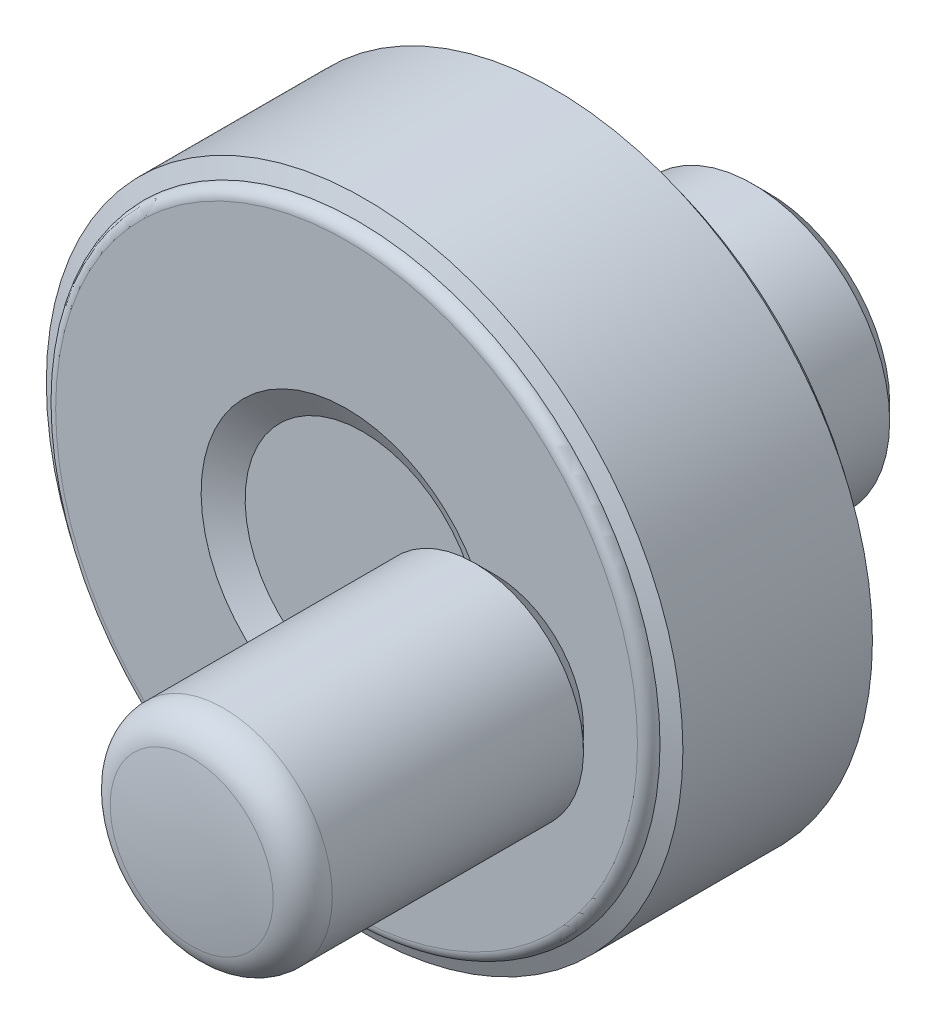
ISO-10303-21;
HEADER;
FILE_DESCRIPTION(('STEP AP214'),'2;1');
FILE_NAME('part.step','',(''),(''),'','','');
FILE_SCHEMA(('AUTOMOTIVE_DESIGN { 1 0 10303 214 1 1 1 1 }'));
ENDSEC;
DATA;
#1=APPLICATION_CONTEXT('core data for automotive mechanical design processes');
#2=APPLICATION_PROTOCOL_DEFINITION('international standard','automotive_design',2000,#1);
#3=PRODUCT_CONTEXT('',#1,'mechanical');
#4=PRODUCT('Part','Part','',(#3));
#5=PRODUCT_RELATED_PRODUCT_CATEGORY('part','',(#4));
#6=PRODUCT_DEFINITION_FORMATION('','',#4);
#7=PRODUCT_DEFINITION_CONTEXT('part definition',#1,'design');
#8=PRODUCT_DEFINITION('design','',#6,#7);
#9=PRODUCT_DEFINITION_SHAPE('','',#8);
#10=(LENGTH_UNIT() NAMED_UNIT(*) SI_UNIT(.MILLI.,.METRE.));
#11=(NAMED_UNIT(*) PLANE_ANGLE_UNIT() SI_UNIT($,.RADIAN.));
#12=(NAMED_UNIT(*) SI_UNIT($,.STERADIAN.) SOLID_ANGLE_UNIT());
#13=UNCERTAINTY_MEASURE_WITH_UNIT(LENGTH_MEASURE(1.E-05),#10,'distance_accuracy_value','');
#14=(GEOMETRIC_REPRESENTATION_CONTEXT(3) GLOBAL_UNCERTAINTY_ASSIGNED_CONTEXT((#13)) GLOBAL_UNIT_ASSIGNED_CONTEXT((#10,
#11,#12)) REPRESENTATION_CONTEXT('',''));
#15=CARTESIAN_POINT('',(0.,0.,0.));
#16=DIRECTION('',(0.,0.,1.));
#17=DIRECTION('',(1.,0.,0.));
#18=AXIS2_PLACEMENT_3D('',#15,#16,#17);
#19=CARTESIAN_POINT('',(-6.66666666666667,0.,2.84529946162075));
#20=DIRECTION('',(0.,-0.5,-0.866025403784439));
#21=DIRECTION('',(0.,-0.866025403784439,0.5));
#22=AXIS2_PLACEMENT_3D('',#19,#20,#21);
#23=PLANE('',#22);
#24=DIRECTION('',(1.,0.,0.));
#25=VECTOR('',#24,1.);
#26=CARTESIAN_POINT('',(-6.66666666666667,-1.,3.42264973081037));
#27=LINE('',#26,#25);
#28=CARTESIAN_POINT('',(-8.5,-1.,3.42264973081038));
#29=VERTEX_POINT('',#28);
#30=CARTESIAN_POINT('',(-6.66666666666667,-1.,3.42264973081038));
#31=VERTEX_POINT('',#30);
#32=EDGE_CURVE('E336',#29,#31,#27,.T.);
#33=ORIENTED_EDGE('',*,*,#32,.T.);
#34=DIRECTION('',(0.,-0.866025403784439,0.5));
#35=VECTOR('',#34,1.);
#36=CARTESIAN_POINT('',(-6.66666666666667,0.,2.84529946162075));
#37=LINE('',#36,#35);
#38=CARTESIAN_POINT('',(-6.66666666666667,0.,2.84529946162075));
#39=VERTEX_POINT('',#38);
#40=EDGE_CURVE('E341',#39,#31,#37,.T.);
#41=ORIENTED_EDGE('',*,*,#40,.F.);
#42=DIRECTION('',(-1.,0.,0.));
#43=VECTOR('',#42,1.);
#44=CARTESIAN_POINT('',(-6.66666666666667,0.,2.84529946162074));
#45=LINE('',#44,#43);
#46=CARTESIAN_POINT('',(-8.5,0.,2.84529946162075));
#47=VERTEX_POINT('',#46);
#48=EDGE_CURVE('E328',#39,#47,#45,.T.);
#49=ORIENTED_EDGE('',*,*,#48,.T.);
#50=DIRECTION('',(0.,-0.866025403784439,0.5));
#51=VECTOR('',#50,1.);
#52=CARTESIAN_POINT('',(-8.5,0.,2.84529946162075));
#53=LINE('',#52,#51);
#54=EDGE_CURVE('E339',#29,#47,#53,.F.);
#55=ORIENTED_EDGE('',*,*,#54,.F.);
#56=EDGE_LOOP('',(#33,#41,#49,#55));
#57=FACE_BOUND('',#56,.T.);
#58=ADVANCED_FACE('F14',(#57),#23,.F.);
#59=CARTESIAN_POINT('',(-6.66666666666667,-1.,3.42264973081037));
#60=DIRECTION('',(0.,-1.,0.));
#61=DIRECTION('',(1.,0.,0.));
#62=AXIS2_PLACEMENT_3D('',#59,#60,#61);
#63=PLANE('',#62);
#64=DIRECTION('',(-1.,0.,0.));
#65=VECTOR('',#64,1.);
#66=CARTESIAN_POINT('',(-6.66666666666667,-1.,4.57735026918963));
#67=LINE('',#66,#65);
#68=CARTESIAN_POINT('',(-8.5,-1.,4.57735026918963));
#69=VERTEX_POINT('',#68);
#70=CARTESIAN_POINT('',(-6.66666666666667,-1.,4.57735026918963));
#71=VERTEX_POINT('',#70);
#72=EDGE_CURVE('E323',#69,#71,#67,.F.);
#73=ORIENTED_EDGE('',*,*,#72,.T.);
#74=DIRECTION('',(0.,0.,1.));
#75=VECTOR('',#74,1.);
#76=CARTESIAN_POINT('',(-6.66666666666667,-1.,3.42264973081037));
#77=LINE('',#76,#75);
#78=EDGE_CURVE('E334',#31,#71,#77,.T.);
#79=ORIENTED_EDGE('',*,*,#78,.F.);
#80=ORIENTED_EDGE('',*,*,#32,.F.);
#81=DIRECTION('',(0.,0.,1.));
#82=VECTOR('',#81,1.);
#83=CARTESIAN_POINT('',(-8.5,-1.,3.42264973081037));
#84=LINE('',#83,#82);
#85=EDGE_CURVE('E331',#69,#29,#84,.F.);
#86=ORIENTED_EDGE('',*,*,#85,.F.);
#87=EDGE_LOOP('',(#73,#79,#80,#86));
#88=FACE_BOUND('',#87,.T.);
#89=ADVANCED_FACE('F386',(#88),#63,.F.);
#90=CARTESIAN_POINT('',(-6.66666666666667,1.,3.42264973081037));
#91=DIRECTION('',(0.,0.5,-0.866025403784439));
#92=DIRECTION('',(0.,-0.866025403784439,-0.5));
#93=AXIS2_PLACEMENT_3D('',#90,#91,#92);
#94=PLANE('',#93);
#95=ORIENTED_EDGE('',*,*,#48,.F.);
#96=DIRECTION('',(0.,-0.866025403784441,-0.5));
#97=VECTOR('',#96,1.);
#98=CARTESIAN_POINT('',(-6.66666666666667,1.,3.42264973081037));
#99=LINE('',#98,#97);
#100=CARTESIAN_POINT('',(-6.66666666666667,1.,3.42264973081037));
#101=VERTEX_POINT('',#100);
#102=EDGE_CURVE('E319',#101,#39,#99,.T.);
#103=ORIENTED_EDGE('',*,*,#102,.F.);
#104=DIRECTION('',(-1.,0.,0.));
#105=VECTOR('',#104,1.);
#106=CARTESIAN_POINT('',(-6.66666666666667,1.,3.42264973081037));
#107=LINE('',#106,#105);
#108=CARTESIAN_POINT('',(-8.5,1.,3.42264973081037));
#109=VERTEX_POINT('',#108);
#110=EDGE_CURVE('E310',#101,#109,#107,.T.);
#111=ORIENTED_EDGE('',*,*,#110,.T.);
#112=DIRECTION('',(0.,-0.866025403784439,-0.5));
#113=VECTOR('',#112,1.);
#114=CARTESIAN_POINT('',(-8.5,1.,3.42264973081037));
#115=LINE('',#114,#113);
#116=EDGE_CURVE('E326',#47,#109,#115,.F.);
#117=ORIENTED_EDGE('',*,*,#116,.F.);
#118=EDGE_LOOP('',(#95,#103,#111,#117));
#119=FACE_BOUND('',#118,.T.);
#120=ADVANCED_FACE('F359',(#119),#94,.F.);
#121=CARTESIAN_POINT('',(0.,0.,20.));
#122=DIRECTION('',(0.,0.,1.));
#123=DIRECTION('',(1.,0.,0.));
#124=AXIS2_PLACEMENT_3D('',#121,#122,#123);
#125=CYLINDRICAL_SURFACE('',#124,19.75);
#126=CARTESIAN_POINT('',(0.,0.,25.38));
#127=DIRECTION('',(0.,0.,1.));
#128=DIRECTION('',(1.,0.,0.));
#129=AXIS2_PLACEMENT_3D('',#126,#127,#128);
#130=CIRCLE('',#129,19.75);
#131=CARTESIAN_POINT('',(19.75,0.,25.38));
#132=VERTEX_POINT('',#131);
#133=EDGE_CURVE('E343',#132,#132,#130,.F.);
#134=ORIENTED_EDGE('',*,*,#133,.T.);
#135=EDGE_LOOP('',(#134));
#136=FACE_BOUND('',#135,.T.);
#137=CARTESIAN_POINT('',(0.,0.,13.62));
#138=DIRECTION('',(0.,0.,1.));
#139=DIRECTION('',(1.,0.,0.));
#140=AXIS2_PLACEMENT_3D('',#137,#138,#139);
#141=CIRCLE('',#140,19.75);
#142=CARTESIAN_POINT('',(19.75,0.,13.62));
#143=VERTEX_POINT('',#142);
#144=EDGE_CURVE('E307',#143,#143,#141,.F.);
#145=ORIENTED_EDGE('',*,*,#144,.F.);
#146=EDGE_LOOP('',(#145));
#147=FACE_BOUND('',#146,.T.);
#148=ADVANCED_FACE('F354',(#136,#147),#125,.T.);
#149=CARTESIAN_POINT('',(-6.66666666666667,-1.,4.57735026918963));
#150=DIRECTION('',(0.,-0.5,0.866025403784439));
#151=DIRECTION('',(0.,0.866025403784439,0.5));
#152=AXIS2_PLACEMENT_3D('',#149,#150,#151);
#153=PLANE('',#152);
#154=DIRECTION('',(-1.,0.,0.));
#155=VECTOR('',#154,1.);
#156=CARTESIAN_POINT('',(-6.66666666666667,0.,5.15470053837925));
#157=LINE('',#156,#155);
#158=CARTESIAN_POINT('',(-8.5,0.,5.15470053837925));
#159=VERTEX_POINT('',#158);
#160=CARTESIAN_POINT('',(-6.66666666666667,0.,5.15470053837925));
#161=VERTEX_POINT('',#160);
#162=EDGE_CURVE('E305',#159,#161,#157,.F.);
#163=ORIENTED_EDGE('',*,*,#162,.T.);
#164=DIRECTION('',(0.,0.866025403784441,0.5));
#165=VECTOR('',#164,1.);
#166=CARTESIAN_POINT('',(-6.66666666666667,-1.,4.57735026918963));
#167=LINE('',#166,#165);
#168=EDGE_CURVE('E316',#71,#161,#167,.T.);
#169=ORIENTED_EDGE('',*,*,#168,.F.);
#170=ORIENTED_EDGE('',*,*,#72,.F.);
#171=DIRECTION('',(0.,0.866025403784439,0.5));
#172=VECTOR('',#171,1.);
#173=CARTESIAN_POINT('',(-8.5,-1.,4.57735026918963));
#174=LINE('',#173,#172);
#175=EDGE_CURVE('E34',#159,#69,#174,.F.);
#176=ORIENTED_EDGE('',*,*,#175,.F.);
#177=EDGE_LOOP('',(#163,#169,#170,#176));
#178=FACE_BOUND('',#177,.T.);
#179=ADVANCED_FACE('F358',(#178),#153,.F.);
#180=CARTESIAN_POINT('',(-6.66666666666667,0.,0.));
#181=DIRECTION('',(-1.,0.,0.));
#182=DIRECTION('',(0.,-1.,0.));
#183=AXIS2_PLACEMENT_3D('',#180,#181,#182);
#184=PLANE('',#183);
#185=ORIENTED_EDGE('',*,*,#78,.T.);
#186=ORIENTED_EDGE('',*,*,#168,.T.);
#187=DIRECTION('',(0.,0.866025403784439,-0.5));
#188=VECTOR('',#187,1.);
#189=CARTESIAN_POINT('',(-6.66666666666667,0.,5.15470053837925));
#190=LINE('',#189,#188);
#191=CARTESIAN_POINT('',(-6.66666666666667,1.,4.57735026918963));
#192=VERTEX_POINT('',#191);
#193=EDGE_CURVE('E303',#161,#192,#190,.T.);
#194=ORIENTED_EDGE('',*,*,#193,.T.);
#195=DIRECTION('',(0.,0.,1.));
#196=VECTOR('',#195,1.);
#197=CARTESIAN_POINT('',(-6.66666666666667,1.,4.57735026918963));
#198=LINE('',#197,#196);
#199=EDGE_CURVE('E313',#192,#101,#198,.F.);
#200=ORIENTED_EDGE('',*,*,#199,.T.);
#201=ORIENTED_EDGE('',*,*,#102,.T.);
#202=ORIENTED_EDGE('',*,*,#40,.T.);
#203=EDGE_LOOP('',(#185,#186,#194,#200,#201,#202));
#204=FACE_BOUND('',#203,.T.);
#205=ADVANCED_FACE('F375',(#204),#184,.T.);
#206=CARTESIAN_POINT('',(-6.66666666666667,1.,4.57735026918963));
#207=DIRECTION('',(0.,1.,0.));
#208=DIRECTION('',(-1.,0.,0.));
#209=AXIS2_PLACEMENT_3D('',#206,#207,#208);
#210=PLANE('',#209);
#211=ORIENTED_EDGE('',*,*,#110,.F.);
#212=ORIENTED_EDGE('',*,*,#199,.F.);
#213=DIRECTION('',(-1.,0.,0.));
#214=VECTOR('',#213,1.);
#215=CARTESIAN_POINT('',(-6.66666666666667,1.,4.57735026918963));
#216=LINE('',#215,#214);
#217=CARTESIAN_POINT('',(-8.5,1.,4.57735026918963));
#218=VERTEX_POINT('',#217);
#219=EDGE_CURVE('E295',#192,#218,#216,.T.);
#220=ORIENTED_EDGE('',*,*,#219,.T.);
#221=DIRECTION('',(0.,0.,1.));
#222=VECTOR('',#221,1.);
#223=CARTESIAN_POINT('',(-8.5,1.,4.57735026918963));
#224=LINE('',#223,#222);
#225=EDGE_CURVE('E308',#109,#218,#224,.T.);
#226=ORIENTED_EDGE('',*,*,#225,.F.);
#227=EDGE_LOOP('',(#211,#212,#220,#226));
#228=FACE_BOUND('',#227,.T.);
#229=ADVANCED_FACE('F366',(#228),#210,.F.);
#230=CARTESIAN_POINT('',(0.,0.,13.62));
#231=DIRECTION('',(0.,0.,1.));
#232=DIRECTION('',(1.,0.,0.));
#233=AXIS2_PLACEMENT_3D('',#230,#231,#232);
#234=CONICAL_SURFACE('',#233,19.75,1.17316833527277);
#235=ORIENTED_EDGE('',*,*,#144,.T.);
#236=EDGE_LOOP('',(#235));
#237=FACE_BOUND('',#236,.T.);
#238=CARTESIAN_POINT('',(0.,0.,13.2));
#239=DIRECTION('',(0.,0.,-1.));
#240=DIRECTION('',(-1.,0.,0.));
#241=AXIS2_PLACEMENT_3D('',#238,#239,#240);
#242=CIRCLE('',#241,18.75);
#243=CARTESIAN_POINT('',(-18.75,0.,13.2));
#244=VERTEX_POINT('',#243);
#245=EDGE_CURVE('E276',#244,#244,#242,.T.);
#246=ORIENTED_EDGE('',*,*,#245,.F.);
#247=EDGE_LOOP('',(#246));
#248=FACE_BOUND('',#247,.T.);
#249=ADVANCED_FACE('F363',(#237,#248),#234,.T.);
#250=CARTESIAN_POINT('',(-6.66666666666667,0.,5.15470053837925));
#251=DIRECTION('',(0.,0.5,0.866025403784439));
#252=DIRECTION('',(0.,0.866025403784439,-0.5));
#253=AXIS2_PLACEMENT_3D('',#250,#251,#252);
#254=PLANE('',#253);
#255=ORIENTED_EDGE('',*,*,#219,.F.);
#256=ORIENTED_EDGE('',*,*,#193,.F.);
#257=ORIENTED_EDGE('',*,*,#162,.F.);
#258=DIRECTION('',(0.,0.866025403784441,-0.5));
#259=VECTOR('',#258,1.);
#260=CARTESIAN_POINT('',(-8.5,0.,5.15470053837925));
#261=LINE('',#260,#259);
#262=EDGE_CURVE('E267',#159,#218,#261,.T.);
#263=ORIENTED_EDGE('',*,*,#262,.T.);
#264=EDGE_LOOP('',(#255,#256,#257,#263));
#265=FACE_BOUND('',#264,.T.);
#266=ADVANCED_FACE('F286',(#265),#254,.F.);
#267=CARTESIAN_POINT('',(0.,0.,13.2));
#268=DIRECTION('',(0.,0.,-1.));
#269=DIRECTION('',(-1.,0.,0.));
#270=AXIS2_PLACEMENT_3D('',#267,#268,#269);
#271=TOROIDAL_SURFACE('',#270,18.05,0.699999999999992);
#272=CARTESIAN_POINT('',(0.,0.,12.5));
#273=DIRECTION('',(0.,0.,1.));
#274=DIRECTION('',(-1.,0.,0.));
#275=AXIS2_PLACEMENT_3D('',#272,#273,#274);
#276=CIRCLE('',#275,18.05);
#277=CARTESIAN_POINT('',(-18.05,0.,12.5));
#278=VERTEX_POINT('',#277);
#279=EDGE_CURVE('E275',#278,#278,#276,.T.);
#280=ORIENTED_EDGE('',*,*,#279,.T.);
#281=EDGE_LOOP('',(#280));
#282=FACE_BOUND('',#281,.T.);
#283=ORIENTED_EDGE('',*,*,#245,.T.);
#284=EDGE_LOOP('',(#283));
#285=FACE_BOUND('',#284,.T.);
#286=ADVANCED_FACE('F281',(#282,#285),#271,.T.);
#287=CARTESIAN_POINT('',(0.,0.,20.));
#288=DIRECTION('',(0.,0.,1.));
#289=DIRECTION('',(1.,0.,0.));
#290=AXIS2_PLACEMENT_3D('',#287,#288,#289);
#291=CYLINDRICAL_SURFACE('',#290,3.);
#292=CARTESIAN_POINT('',(0.,0.,0.));
#293=DIRECTION('',(0.,0.,1.));
#294=DIRECTION('',(1.,0.,0.));
#295=AXIS2_PLACEMENT_3D('',#292,#293,#294);
#296=CIRCLE('',#295,3.);
#297=CARTESIAN_POINT('',(3.,0.,0.));
#298=VERTEX_POINT('',#297);
#299=EDGE_CURVE('E100',#298,#298,#296,.F.);
#300=ORIENTED_EDGE('',*,*,#299,.T.);
#301=EDGE_LOOP('',(#300));
#302=FACE_BOUND('',#301,.T.);
#303=CARTESIAN_POINT('',(0.,0.,14.));
#304=DIRECTION('',(0.,0.,-1.));
#305=DIRECTION('',(1.,0.,0.));
#306=AXIS2_PLACEMENT_3D('',#303,#304,#305);
#307=CIRCLE('',#306,3.);
#308=CARTESIAN_POINT('',(3.,0.,14.));
#309=VERTEX_POINT('',#308);
#310=EDGE_CURVE('E474',#309,#309,#307,.T.);
#311=ORIENTED_EDGE('',*,*,#310,.F.);
#312=EDGE_LOOP('',(#311));
#313=FACE_BOUND('',#312,.T.);
#314=ADVANCED_FACE('F285',(#302,#313),#291,.F.);
#315=CARTESIAN_POINT('',(-8.5,0.,5.5705));
#316=DIRECTION('',(1.,0.,0.));
#317=DIRECTION('',(0.,1.,0.));
#318=AXIS2_PLACEMENT_3D('',#315,#316,#317);
#319=PLANE('',#318);
#320=CARTESIAN_POINT('',(-8.50000000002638,0.,4.));
#321=DIRECTION('',(1.,0.,0.));
#322=DIRECTION('',(0.,1.,0.));
#323=AXIS2_PLACEMENT_3D('',#320,#321,#322);
#324=CIRCLE('',#323,1.57050000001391);
#325=CARTESIAN_POINT('',(-8.50000000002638,1.57050000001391,4.));
#326=VERTEX_POINT('',#325);
#327=EDGE_CURVE('E415',#326,#326,#324,.T.);
#328=ORIENTED_EDGE('',*,*,#327,.F.);
#329=EDGE_LOOP('',(#328));
#330=FACE_BOUND('',#329,.T.);
#331=ORIENTED_EDGE('',*,*,#175,.T.);
#332=ORIENTED_EDGE('',*,*,#85,.T.);
#333=ORIENTED_EDGE('',*,*,#54,.T.);
#334=ORIENTED_EDGE('',*,*,#116,.T.);
#335=ORIENTED_EDGE('',*,*,#225,.T.);
#336=ORIENTED_EDGE('',*,*,#262,.F.);
#337=EDGE_LOOP('',(#331,#332,#333,#334,#335,#336));
#338=FACE_BOUND('',#337,.T.);
#339=ADVANCED_FACE('F257',(#330,#338),#319,.F.);
#340=CARTESIAN_POINT('',(-18.05,0.,12.5));
#341=DIRECTION('',(0.,0.,1.));
#342=DIRECTION('',(1.,0.,0.));
#343=AXIS2_PLACEMENT_3D('',#340,#341,#342);
#344=PLANE('',#343);
#345=ORIENTED_EDGE('',*,*,#279,.F.);
#346=EDGE_LOOP('',(#345));
#347=FACE_BOUND('',#346,.T.);
#348=CARTESIAN_POINT('',(0.,0.,12.5));
#349=DIRECTION('',(0.,0.,1.));
#350=DIRECTION('',(1.,0.,0.));
#351=AXIS2_PLACEMENT_3D('',#348,#349,#350);
#352=CIRCLE('',#351,16.);
#353=CARTESIAN_POINT('',(16.,0.,12.5));
#354=VERTEX_POINT('',#353);
#355=EDGE_CURVE('E417',#354,#354,#352,.T.);
#356=ORIENTED_EDGE('',*,*,#355,.T.);
#357=EDGE_LOOP('',(#356));
#358=FACE_BOUND('',#357,.T.);
#359=ADVANCED_FACE('F252',(#347,#358),#344,.F.);
#360=CARTESIAN_POINT('',(-6.,0.,0.));
#361=DIRECTION('',(0.,0.,1.));
#362=DIRECTION('',(1.,0.,0.));
#363=AXIS2_PLACEMENT_3D('',#360,#361,#362);
#364=PLANE('',#363);
#365=CARTESIAN_POINT('',(0.,0.,0.));
#366=DIRECTION('',(0.,0.,1.));
#367=DIRECTION('',(1.,0.,0.));
#368=AXIS2_PLACEMENT_3D('',#365,#366,#367);
#369=CIRCLE('',#368,6.);
#370=CARTESIAN_POINT('',(6.,0.,0.));
#371=VERTEX_POINT('',#370);
#372=EDGE_CURVE('E419',#371,#371,#369,.T.);
#373=ORIENTED_EDGE('',*,*,#372,.F.);
#374=EDGE_LOOP('',(#373));
#375=FACE_BOUND('',#374,.T.);
#376=ORIENTED_EDGE('',*,*,#299,.F.);
#377=EDGE_LOOP('',(#376));
#378=FACE_BOUND('',#377,.T.);
#379=ADVANCED_FACE('F248',(#375,#378),#364,.F.);
#380=CARTESIAN_POINT('',(-8.07049999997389,0.,4.));
#381=DIRECTION('',(1.,0.,0.));
#382=DIRECTION('',(0.,1.,0.));
#383=AXIS2_PLACEMENT_3D('',#380,#381,#382);
#384=CONICAL_SURFACE('',#383,2.00000000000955,0.785398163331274);
#385=CARTESIAN_POINT('',(-8.0705,0.,4.));
#386=DIRECTION('',(1.,0.,0.));
#387=DIRECTION('',(0.,1.,0.));
#388=AXIS2_PLACEMENT_3D('',#385,#386,#387);
#389=CIRCLE('',#388,2.);
#390=CARTESIAN_POINT('',(-8.0705,2.,4.));
#391=VERTEX_POINT('',#390);
#392=EDGE_CURVE('E425',#391,#391,#389,.T.);
#393=ORIENTED_EDGE('',*,*,#392,.F.);
#394=EDGE_LOOP('',(#393));
#395=FACE_BOUND('',#394,.T.);
#396=ORIENTED_EDGE('',*,*,#327,.T.);
#397=EDGE_LOOP('',(#396));
#398=FACE_BOUND('',#397,.T.);
#399=ADVANCED_FACE('F244',(#395,#398),#384,.T.);
#400=CARTESIAN_POINT('',(0.,0.,20.));
#401=DIRECTION('',(0.,0.,1.));
#402=DIRECTION('',(1.,0.,0.));
#403=AXIS2_PLACEMENT_3D('',#400,#401,#402);
#404=CYLINDRICAL_SURFACE('',#403,16.);
#405=ORIENTED_EDGE('',*,*,#355,.F.);
#406=EDGE_LOOP('',(#405));
#407=FACE_BOUND('',#406,.T.);
#408=CARTESIAN_POINT('',(0.,0.,24.5));
#409=DIRECTION('',(0.,0.,-1.));
#410=DIRECTION('',(-1.,0.,0.));
#411=AXIS2_PLACEMENT_3D('',#408,#409,#410);
#412=CIRCLE('',#411,16.);
#413=CARTESIAN_POINT('',(-16.,0.,24.5));
#414=VERTEX_POINT('',#413);
#415=EDGE_CURVE('E430',#414,#414,#412,.F.);
#416=ORIENTED_EDGE('',*,*,#415,.T.);
#417=EDGE_LOOP('',(#416));
#418=FACE_BOUND('',#417,.T.);
#419=ADVANCED_FACE('F240',(#407,#418),#404,.F.);
#420=CARTESIAN_POINT('',(0.,0.,20.));
#421=DIRECTION('',(0.,0.,1.));
#422=DIRECTION('',(1.,0.,0.));
#423=AXIS2_PLACEMENT_3D('',#420,#421,#422);
#424=CYLINDRICAL_SURFACE('',#423,6.);
#425=CARTESIAN_POINT('',(0.,0.,0.3));
#426=DIRECTION('',(0.,0.,1.));
#427=DIRECTION('',(1.,0.,0.));
#428=AXIS2_PLACEMENT_3D('',#425,#426,#427);
#429=CIRCLE('',#428,6.);
#430=CARTESIAN_POINT('',(6.,0.,0.3));
#431=VERTEX_POINT('',#430);
#432=EDGE_CURVE('E426',#431,#431,#429,.F.);
#433=ORIENTED_EDGE('',*,*,#432,.T.);
#434=EDGE_LOOP('',(#433));
#435=FACE_BOUND('',#434,.T.);
#436=ORIENTED_EDGE('',*,*,#372,.T.);
#437=EDGE_LOOP('',(#436));
#438=FACE_BOUND('',#437,.T.);
#439=ADVANCED_FACE('F236',(#435,#438),#424,.T.);
#440=CARTESIAN_POINT('',(-8.5,0.,4.));
#441=DIRECTION('',(1.,0.,0.));
#442=DIRECTION('',(0.,1.,0.));
#443=AXIS2_PLACEMENT_3D('',#440,#441,#442);
#444=CYLINDRICAL_SURFACE('',#443,2.);
#445=CARTESIAN_POINT('',(-6.00000000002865,0.,4.));
#446=DIRECTION('',(-1.,0.,0.));
#447=DIRECTION('',(0.,-1.,0.));
#448=AXIS2_PLACEMENT_3D('',#445,#446,#447);
#449=CIRCLE('',#448,1.9999999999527);
#450=CARTESIAN_POINT('',(-6.00000000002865,-1.9999999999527,4.));
#451=VERTEX_POINT('',#450);
#452=EDGE_CURVE('E429',#451,#451,#449,.T.);
#453=ORIENTED_EDGE('',*,*,#452,.T.);
#454=EDGE_LOOP('',(#453));
#455=FACE_BOUND('',#454,.T.);
#456=ORIENTED_EDGE('',*,*,#392,.T.);
#457=EDGE_LOOP('',(#456));
#458=FACE_BOUND('',#457,.T.);
#459=ADVANCED_FACE('F232',(#455,#458),#444,.T.);
#460=CARTESIAN_POINT('',(0.,0.,24.5));
#461=DIRECTION('',(0.,0.,-1.));
#462=DIRECTION('',(0.,-1.,0.));
#463=AXIS2_PLACEMENT_3D('',#460,#461,#462);
#464=CONICAL_SURFACE('',#463,16.,0.78539816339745);
#465=ORIENTED_EDGE('',*,*,#415,.F.);
#466=EDGE_LOOP('',(#465));
#467=FACE_BOUND('',#466,.T.);
#468=CARTESIAN_POINT('',(0.,0.,25.5));
#469=DIRECTION('',(0.,0.,-1.));
#470=DIRECTION('',(0.,-1.,0.));
#471=AXIS2_PLACEMENT_3D('',#468,#469,#470);
#472=CIRCLE('',#471,15.);
#473=CARTESIAN_POINT('',(0.,-15.,25.5));
#474=VERTEX_POINT('',#473);
#475=EDGE_CURVE('E431',#474,#474,#472,.F.);
#476=ORIENTED_EDGE('',*,*,#475,.T.);
#477=EDGE_LOOP('',(#476));
#478=FACE_BOUND('',#477,.T.);
#479=ADVANCED_FACE('F228',(#467,#478),#464,.F.);
#480=CARTESIAN_POINT('',(-7.5,0.,0.3));
#481=DIRECTION('',(0.,0.,1.));
#482=DIRECTION('',(1.,0.,0.));
#483=AXIS2_PLACEMENT_3D('',#480,#481,#482);
#484=PLANE('',#483);
#485=CARTESIAN_POINT('',(0.,0.,0.3));
#486=DIRECTION('',(0.,0.,1.));
#487=DIRECTION('',(1.,0.,0.));
#488=AXIS2_PLACEMENT_3D('',#485,#486,#487);
#489=CIRCLE('',#488,7.5);
#490=CARTESIAN_POINT('',(7.5,0.,0.3));
#491=VERTEX_POINT('',#490);
#492=EDGE_CURVE('E433',#491,#491,#489,.T.);
#493=ORIENTED_EDGE('',*,*,#492,.F.);
#494=EDGE_LOOP('',(#493));
#495=FACE_BOUND('',#494,.T.);
#496=ORIENTED_EDGE('',*,*,#432,.F.);
#497=EDGE_LOOP('',(#496));
#498=FACE_BOUND('',#497,.T.);
#499=ADVANCED_FACE('F224',(#495,#498),#484,.F.);
#500=CARTESIAN_POINT('',(-6.22222222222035,0.,4.));
#501=DIRECTION('',(-1.,0.,0.));
#502=DIRECTION('',(0.,-1.,0.));
#503=AXIS2_PLACEMENT_3D('',#500,#501,#502);
#504=CONICAL_SURFACE('',#503,2.22222222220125,0.785398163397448);
#505=ORIENTED_EDGE('',*,*,#452,.F.);
#506=EDGE_LOOP('',(#505));
#507=FACE_BOUND('',#506,.T.);
#508=CARTESIAN_POINT('',(-6.22222222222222,0.,4.));
#509=DIRECTION('',(1.,0.,0.));
#510=DIRECTION('',(0.,1.,0.));
#511=AXIS2_PLACEMENT_3D('',#508,#509,#510);
#512=CIRCLE('',#511,2.22222222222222);
#513=CARTESIAN_POINT('',(-6.22222222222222,2.22222222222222,4.));
#514=VERTEX_POINT('',#513);
#515=EDGE_CURVE('E435',#514,#514,#512,.F.);
#516=ORIENTED_EDGE('',*,*,#515,.T.);
#517=EDGE_LOOP('',(#516));
#518=FACE_BOUND('',#517,.T.);
#519=ADVANCED_FACE('F220',(#507,#518),#504,.F.);
#520=CARTESIAN_POINT('',(-15.,0.,25.5));
#521=DIRECTION('',(0.,0.,1.));
#522=DIRECTION('',(1.,0.,0.));
#523=AXIS2_PLACEMENT_3D('',#520,#521,#522);
#524=PLANE('',#523);
#525=ORIENTED_EDGE('',*,*,#475,.F.);
#526=EDGE_LOOP('',(#525));
#527=FACE_BOUND('',#526,.T.);
#528=CARTESIAN_POINT('',(0.,0.,25.5));
#529=DIRECTION('',(0.,0.,1.));
#530=DIRECTION('',(0.,1.,0.));
#531=AXIS2_PLACEMENT_3D('',#528,#529,#530);
#532=CIRCLE('',#531,9.5);
#533=CARTESIAN_POINT('',(0.,9.5,25.5));
#534=VERTEX_POINT('',#533);
#535=EDGE_CURVE('E207',#534,#534,#532,.F.);
#536=ORIENTED_EDGE('',*,*,#535,.F.);
#537=EDGE_LOOP('',(#536));
#538=FACE_BOUND('',#537,.T.);
#539=ADVANCED_FACE('F216',(#527,#538),#524,.F.);
#540=CARTESIAN_POINT('',(0.,0.,1.3));
#541=DIRECTION('',(0.,0.,1.));
#542=DIRECTION('',(1.,0.,0.));
#543=AXIS2_PLACEMENT_3D('',#540,#541,#542);
#544=CONICAL_SURFACE('',#543,8.5,0.785398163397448);
#545=CARTESIAN_POINT('',(0.,0.,1.3));
#546=DIRECTION('',(0.,0.,1.));
#547=DIRECTION('',(1.,0.,0.));
#548=AXIS2_PLACEMENT_3D('',#545,#546,#547);
#549=CIRCLE('',#548,8.5);
#550=CARTESIAN_POINT('',(8.5,0.,1.3));
#551=VERTEX_POINT('',#550);
#552=EDGE_CURVE('E206',#551,#551,#549,.T.);
#553=ORIENTED_EDGE('',*,*,#552,.F.);
#554=EDGE_LOOP('',(#553));
#555=FACE_BOUND('',#554,.T.);
#556=ORIENTED_EDGE('',*,*,#492,.T.);
#557=EDGE_LOOP('',(#556));
#558=FACE_BOUND('',#557,.T.);
#559=ADVANCED_FACE('F212',(#555,#558),#544,.T.);
#560=CARTESIAN_POINT('',(-8.5,0.,4.));
#561=DIRECTION('',(1.,0.,0.));
#562=DIRECTION('',(0.,1.,0.));
#563=AXIS2_PLACEMENT_3D('',#560,#561,#562);
#564=CYLINDRICAL_SURFACE('',#563,2.22222222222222);
#565=ORIENTED_EDGE('',*,*,#515,.F.);
#566=EDGE_LOOP('',(#565));
#567=FACE_BOUND('',#566,.T.);
#568=CARTESIAN_POINT('',(-8.49928661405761,-0.110124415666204,6.21949190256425));
#569=CARTESIAN_POINT('',(-8.4976923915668,-0.233011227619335,6.2133913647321));
#570=CARTESIAN_POINT('',(-8.49341681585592,-0.355391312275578,6.1970569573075));
#571=CARTESIAN_POINT('',(-8.47996556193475,-0.595550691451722,6.14446302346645));
#572=CARTESIAN_POINT('',(-8.47078706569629,-0.713327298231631,6.10819203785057));
#573=CARTESIAN_POINT('',(-8.44854601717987,-0.940809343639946,6.01696473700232));
#574=CARTESIAN_POINT('',(-8.43548878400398,-1.05052558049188,5.96203399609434));
#575=CARTESIAN_POINT('',(-8.40687196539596,-1.25921128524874,5.83509676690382));
#576=CARTESIAN_POINT('',(-8.39131227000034,-1.3581802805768,5.76308952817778));
#577=CARTESIAN_POINT('',(-8.35898445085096,-1.54484643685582,5.60225276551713));
#578=CARTESIAN_POINT('',(-8.34219785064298,-1.63226431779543,5.51310268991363));
#579=CARTESIAN_POINT('',(-8.30955706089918,-1.79104670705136,5.32133341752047));
#580=CARTESIAN_POINT('',(-8.29370295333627,-1.8624098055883,5.21871303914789));
#581=CARTESIAN_POINT('',(-8.2645636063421,-1.98776024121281,5.00148487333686));
#582=CARTESIAN_POINT('',(-8.2513081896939,-2.04155010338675,4.88675882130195));
#583=CARTESIAN_POINT('',(-8.22919240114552,-2.12895349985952,4.64946581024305));
#584=CARTESIAN_POINT('',(-8.22033109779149,-2.16257131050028,4.52690051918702));
#585=CARTESIAN_POINT('',(-8.20828161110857,-2.20786168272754,4.28082019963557));
#586=CARTESIAN_POINT('',(-8.2049515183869,-2.22008363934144,4.15741327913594));
#587=CARTESIAN_POINT('',(-8.20393311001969,-2.22384539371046,3.91027106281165));
#588=CARTESIAN_POINT('',(-8.20624400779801,-2.21538807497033,3.78653581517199));
#589=CARTESIAN_POINT('',(-8.21610429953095,-2.17852553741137,3.54517004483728));
#590=CARTESIAN_POINT('',(-8.22353449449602,-2.15057404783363,3.42746479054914));
#591=CARTESIAN_POINT('',(-8.24264413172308,-2.07612223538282,3.19844461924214));
#592=CARTESIAN_POINT('',(-8.25432402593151,-2.02961993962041,3.08713038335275));
#593=CARTESIAN_POINT('',(-8.28085877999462,-1.9185099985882,2.87194811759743));
#594=CARTESIAN_POINT('',(-8.29576384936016,-1.85361031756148,2.76823727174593));
#595=CARTESIAN_POINT('',(-8.32699557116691,-1.70783170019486,2.57296277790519));
#596=CARTESIAN_POINT('',(-8.34332249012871,-1.62694976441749,2.48140141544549));
#597=CARTESIAN_POINT('',(-8.37615114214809,-1.44863270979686,2.31018903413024));
#598=CARTESIAN_POINT('',(-8.39264355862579,-1.35077573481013,2.23097484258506));
#599=CARTESIAN_POINT('',(-8.42347251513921,-1.14286421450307,2.0900516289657));
#600=CARTESIAN_POINT('',(-8.43780908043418,-1.03280981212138,2.02834240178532));
#601=CARTESIAN_POINT('',(-8.46269523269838,-0.803750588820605,1.92441996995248));
#602=CARTESIAN_POINT('',(-8.47325366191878,-0.684767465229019,1.8821611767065));
#603=CARTESIAN_POINT('',(-8.48942659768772,-0.441055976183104,1.81834955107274));
#604=CARTESIAN_POINT('',(-8.4950421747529,-0.31632886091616,1.79679223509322));
#605=CARTESIAN_POINT('',(-8.50059991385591,-0.0685909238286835,1.77546153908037));
#606=CARTESIAN_POINT('',(-8.50070337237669,0.0543632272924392,1.77506883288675));
#607=CARTESIAN_POINT('',(-8.4956332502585,0.298541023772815,1.79451978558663));
#608=CARTESIAN_POINT('',(-8.49046000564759,0.419764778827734,1.81436215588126));
#609=CARTESIAN_POINT('',(-8.4754883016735,0.655688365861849,1.87327321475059));
#610=CARTESIAN_POINT('',(-8.46574192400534,0.770445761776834,1.91212561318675));
#611=CARTESIAN_POINT('',(-8.44266826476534,0.991843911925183,2.00774920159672));
#612=CARTESIAN_POINT('',(-8.42934051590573,1.09848360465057,2.06452273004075));
#613=CARTESIAN_POINT('',(-8.40013872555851,1.30331458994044,2.19589713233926));
#614=CARTESIAN_POINT('',(-8.38421291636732,1.4012534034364,2.27087999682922));
#615=CARTESIAN_POINT('',(-8.35173746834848,1.58336796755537,2.43592676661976));
#616=CARTESIAN_POINT('',(-8.33518771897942,1.66754126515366,2.5259933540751));
#617=CARTESIAN_POINT('',(-8.30285920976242,1.82178511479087,2.72124506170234));
#618=CARTESIAN_POINT('',(-8.28710848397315,1.89146874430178,2.82674113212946));
#619=CARTESIAN_POINT('',(-8.25865266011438,2.01209221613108,3.04833575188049));
#620=CARTESIAN_POINT('',(-8.2459472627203,2.06303390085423,3.16443325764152));
#621=CARTESIAN_POINT('',(-8.22525609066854,2.1440387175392,3.40251794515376));
#622=CARTESIAN_POINT('',(-8.21721461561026,2.17434903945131,3.5244159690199));
#623=CARTESIAN_POINT('',(-8.20661648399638,2.21401876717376,3.77179825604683));
#624=CARTESIAN_POINT('',(-8.20405857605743,2.22338295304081,3.89728169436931));
#625=CARTESIAN_POINT('',(-8.20473824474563,2.22087034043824,4.14411677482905));
#626=CARTESIAN_POINT('',(-8.20779885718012,2.20964214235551,4.26547606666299));
#627=CARTESIAN_POINT('',(-8.21900182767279,2.16759663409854,4.50450257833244));
#628=CARTESIAN_POINT('',(-8.22714426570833,2.13677901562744,4.62216974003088));
#629=CARTESIAN_POINT('',(-8.24755631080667,2.05657774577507,4.85053032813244));
#630=CARTESIAN_POINT('',(-8.25982391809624,2.00720308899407,4.96122710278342));
#631=CARTESIAN_POINT('',(-8.28712100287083,1.89133686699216,5.1728939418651));
#632=CARTESIAN_POINT('',(-8.3021509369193,1.8248424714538,5.27386239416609));
#633=CARTESIAN_POINT('',(-8.33385015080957,1.6742248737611,5.46650758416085));
#634=CARTESIAN_POINT('',(-8.3505555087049,1.58962472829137,5.55780572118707));
#635=CARTESIAN_POINT('',(-8.3833727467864,1.40631337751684,5.72509563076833));
#636=CARTESIAN_POINT('',(-8.39948450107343,1.30759920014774,5.80108417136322));
#637=CARTESIAN_POINT('',(-8.42958781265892,1.09704779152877,5.9366641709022));
#638=CARTESIAN_POINT('',(-8.44354412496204,0.985036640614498,5.99599388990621));
#639=CARTESIAN_POINT('',(-8.46745421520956,0.752241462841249,6.09484358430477));
#640=CARTESIAN_POINT('',(-8.47741086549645,0.631463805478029,6.13437778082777));
#641=CARTESIAN_POINT('',(-8.4908471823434,0.407146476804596,6.18706869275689));
#642=CARTESIAN_POINT('',(-8.49517510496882,0.304463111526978,6.20371342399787));
#643=CARTESIAN_POINT('',(-8.50006751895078,0.0976912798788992,6.22249920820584));
#644=CARTESIAN_POINT('',(-8.50063227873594,-0.00639708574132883,6.22464129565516));
#645=CARTESIAN_POINT('',(-8.49928661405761,-0.110124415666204,6.21949190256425));
#646=B_SPLINE_CURVE_WITH_KNOTS('',3,(#568,#569,#570,#571,#572,#573,#574,#575,#576,#577,#578,
#579,#580,#581,#582,#583,#584,#585,#586,#587,#588,#589,#590,#591,#592,#593,#594,#595,#596,#597,
#598,#599,#600,#601,#602,#603,#604,#605,#606,#607,#608,#609,#610,#611,#612,#613,#614,#615,#616,
#617,#618,#619,#620,#621,#622,#623,#624,#625,#626,#627,#628,#629,#630,#631,#632,#633,#634,#635,
#636,#637,#638,#639,#640,#641,#642,#643,#644,#645),.UNSPECIFIED.,.T.,.F.,(4,2,2,2,2,2,2,2,2,2,2,
2,2,2,2,2,2,2,2,2,2,2,2,2,2,2,2,2,2,2,2,2,2,2,2,2,2,2,4),(0.,0.368762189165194,
0.737736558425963,1.10620725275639,1.47469414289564,1.85089359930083,2.22712607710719,
2.60745154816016,2.98769636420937,3.35802573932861,3.72830347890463,4.09023867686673,
4.45221237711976,4.82028891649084,5.18843459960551,5.56756350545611,5.94668796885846,
6.32491924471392,6.70306858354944,7.07014618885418,7.43720041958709,7.80017226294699,
8.1631914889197,8.5346077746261,8.90609017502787,9.28648759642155,9.66684761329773,
10.0425661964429,10.418199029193,10.7822030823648,11.1462128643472,11.5100464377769,
11.873940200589,12.2489627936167,12.6240644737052,13.0047662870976,13.3851942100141,
13.696484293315,14.0077521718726),.UNSPECIFIED.);
#647=CARTESIAN_POINT('',(-8.49928661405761,-0.110124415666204,6.21949190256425));
#648=VERTEX_POINT('',#647);
#649=EDGE_CURVE('E25',#648,#648,#646,.T.);
#650=ORIENTED_EDGE('',*,*,#649,.F.);
#651=EDGE_LOOP('',(#650));
#652=FACE_BOUND('',#651,.T.);
#653=ADVANCED_FACE('F194',(#567,#652),#564,.F.);
#654=CARTESIAN_POINT('',(0.,0.,25.5));
#655=DIRECTION('',(0.,0.,1.));
#656=DIRECTION('',(0.,1.,0.));
#657=AXIS2_PLACEMENT_3D('',#654,#655,#656);
#658=CONICAL_SURFACE('',#657,9.5,0.785398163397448);
#659=ORIENTED_EDGE('',*,*,#535,.T.);
#660=EDGE_LOOP('',(#659));
#661=FACE_BOUND('',#660,.T.);
#662=CARTESIAN_POINT('',(0.,0.,24.5));
#663=DIRECTION('',(0.,0.,1.));
#664=DIRECTION('',(1.,0.,0.));
#665=AXIS2_PLACEMENT_3D('',#662,#663,#664);
#666=CIRCLE('',#665,8.5);
#667=CARTESIAN_POINT('',(8.5,0.,24.5));
#668=VERTEX_POINT('',#667);
#669=EDGE_CURVE('E9',#668,#668,#666,.F.);
#670=ORIENTED_EDGE('',*,*,#669,.F.);
#671=EDGE_LOOP('',(#670));
#672=FACE_BOUND('',#671,.T.);
#673=ADVANCED_FACE('F186',(#661,#672),#658,.T.);
#674=CARTESIAN_POINT('',(0.,0.,20.));
#675=DIRECTION('',(0.,0.,1.));
#676=DIRECTION('',(1.,0.,0.));
#677=AXIS2_PLACEMENT_3D('',#674,#675,#676);
#678=CYLINDRICAL_SURFACE('',#677,8.5);
#679=ORIENTED_EDGE('',*,*,#669,.T.);
#680=EDGE_LOOP('',(#679));
#681=FACE_BOUND('',#680,.T.);
#682=ORIENTED_EDGE('',*,*,#649,.T.);
#683=EDGE_LOOP('',(#682));
#684=FACE_BOUND('',#683,.T.);
#685=ORIENTED_EDGE('',*,*,#552,.T.);
#686=EDGE_LOOP('',(#685));
#687=FACE_BOUND('',#686,.T.);
#688=ADVANCED_FACE('F184',(#681,#684,#687),#678,.T.);
#689=CARTESIAN_POINT('',(10.,-1.48969378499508E-13,13.6053571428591));
#690=DIRECTION('',(0.,-1.,0.));
#691=DIRECTION('',(-1.,0.,0.));
#692=AXIS2_PLACEMENT_3D('',#689,#690,#691);
#693=SPHERICAL_SURFACE('',#692,32.8946428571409);
#694=CARTESIAN_POINT('',(10.,0.,46.1088839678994));
#695=DIRECTION('',(0.,0.,-1.));
#696=DIRECTION('',(0.,-1.,0.));
#697=AXIS2_PLACEMENT_3D('',#694,#695,#696);
#698=CIRCLE('',#697,5.05749667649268);
#699=CARTESIAN_POINT('',(10.,-5.05749667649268,46.1088839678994));
#700=VERTEX_POINT('',#699);
#701=EDGE_CURVE('E19',#700,#700,#698,.T.);
#702=ORIENTED_EDGE('',*,*,#701,.F.);
#703=EDGE_LOOP('',(#702));
#704=FACE_BOUND('',#703,.T.);
#705=ADVANCED_FACE('F16',(#704),#693,.T.);
#706=CARTESIAN_POINT('',(10.,0.,44.1326638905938));
#707=DIRECTION('',(0.,0.,-1.));
#708=DIRECTION('',(0.,-1.,0.));
#709=AXIS2_PLACEMENT_3D('',#706,#707,#708);
#710=TOROIDAL_SURFACE('',#709,4.75,2.);
#711=CARTESIAN_POINT('',(10.,0.,44.1326638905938));
#712=DIRECTION('',(0.,0.,1.));
#713=DIRECTION('',(0.,1.,0.));
#714=AXIS2_PLACEMENT_3D('',#711,#712,#713);
#715=CIRCLE('',#714,6.75);
#716=CARTESIAN_POINT('',(10.,6.75,44.1326638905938));
#717=VERTEX_POINT('',#716);
#718=EDGE_CURVE('E111',#717,#717,#715,.F.);
#719=ORIENTED_EDGE('',*,*,#718,.F.);
#720=EDGE_LOOP('',(#719));
#721=FACE_BOUND('',#720,.T.);
#722=ORIENTED_EDGE('',*,*,#701,.T.);
#723=EDGE_LOOP('',(#722));
#724=FACE_BOUND('',#723,.T.);
#725=ADVANCED_FACE('F130',(#721,#724),#710,.T.);
#726=CARTESIAN_POINT('',(10.,0.,26.5));
#727=DIRECTION('',(0.,0.,1.));
#728=DIRECTION('',(0.,1.,0.));
#729=AXIS2_PLACEMENT_3D('',#726,#727,#728);
#730=CYLINDRICAL_SURFACE('',#729,6.75);
#731=ORIENTED_EDGE('',*,*,#718,.T.);
#732=EDGE_LOOP('',(#731));
#733=FACE_BOUND('',#732,.T.);
#734=CARTESIAN_POINT('',(10.,0.,28.5499999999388));
#735=DIRECTION('',(0.,0.,1.));
#736=DIRECTION('',(0.,1.,0.));
#737=AXIS2_PLACEMENT_3D('',#734,#735,#736);
#738=CIRCLE('',#737,6.75000000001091);
#739=CARTESIAN_POINT('',(10.,6.75000000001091,28.5499999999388));
#740=VERTEX_POINT('',#739);
#741=EDGE_CURVE('E107',#740,#740,#738,.F.);
#742=ORIENTED_EDGE('',*,*,#741,.F.);
#743=EDGE_LOOP('',(#742));
#744=FACE_BOUND('',#743,.T.);
#745=ADVANCED_FACE('F133',(#733,#744),#730,.T.);
#746=CARTESIAN_POINT('',(10.,0.,28.549999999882));
#747=DIRECTION('',(0.,0.,1.));
#748=DIRECTION('',(0.,1.,0.));
#749=AXIS2_PLACEMENT_3D('',#746,#747,#748);
#750=CONICAL_SURFACE('',#749,6.74999999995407,0.785398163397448);
#751=ORIENTED_EDGE('',*,*,#741,.T.);
#752=EDGE_LOOP('',(#751));
#753=FACE_BOUND('',#752,.T.);
#754=CARTESIAN_POINT('',(10.,0.,27.2999999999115));
#755=DIRECTION('',(0.,0.,1.));
#756=DIRECTION('',(0.,1.,0.));
#757=AXIS2_PLACEMENT_3D('',#754,#755,#756);
#758=CIRCLE('',#757,5.49999999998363);
#759=CARTESIAN_POINT('',(10.,5.49999999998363,27.2999999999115));
#760=VERTEX_POINT('',#759);
#761=EDGE_CURVE('E80',#760,#760,#758,.T.);
#762=ORIENTED_EDGE('',*,*,#761,.T.);
#763=EDGE_LOOP('',(#762));
#764=FACE_BOUND('',#763,.T.);
#765=ADVANCED_FACE('F137',(#753,#764),#750,.T.);
#766=CARTESIAN_POINT('',(10.,-5.5,27.3));
#767=DIRECTION('',(0.,0.,1.));
#768=DIRECTION('',(0.,1.,0.));
#769=AXIS2_PLACEMENT_3D('',#766,#767,#768);
#770=PLANE('',#769);
#771=ORIENTED_EDGE('',*,*,#761,.F.);
#772=EDGE_LOOP('',(#771));
#773=FACE_BOUND('',#772,.T.);
#774=CARTESIAN_POINT('',(10.,0.,27.3));
#775=DIRECTION('',(0.,0.,1.));
#776=DIRECTION('',(0.,1.,0.));
#777=AXIS2_PLACEMENT_3D('',#774,#775,#776);
#778=CIRCLE('',#777,3.);
#779=CARTESIAN_POINT('',(10.,3.,27.3));
#780=VERTEX_POINT('',#779);
#781=EDGE_CURVE('E88',#780,#780,#778,.F.);
#782=ORIENTED_EDGE('',*,*,#781,.F.);
#783=EDGE_LOOP('',(#782));
#784=FACE_BOUND('',#783,.T.);
#785=ADVANCED_FACE('F141',(#773,#784),#770,.F.);
#786=CARTESIAN_POINT('',(10.,-3.,26.5));
#787=DIRECTION('',(0.,0.,1.));
#788=DIRECTION('',(0.,1.,0.));
#789=AXIS2_PLACEMENT_3D('',#786,#787,#788);
#790=PLANE('',#789);
#791=CARTESIAN_POINT('',(0.,0.,26.5));
#792=DIRECTION('',(0.,0.,1.));
#793=DIRECTION('',(0.,1.,0.));
#794=AXIS2_PLACEMENT_3D('',#791,#792,#793);
#795=CIRCLE('',#794,9.025);
#796=CARTESIAN_POINT('',(8.62253125,2.66506657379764,26.5));
#797=VERTEX_POINT('',#796);
#798=CARTESIAN_POINT('',(8.62253125,-2.66506657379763,26.5));
#799=VERTEX_POINT('',#798);
#800=EDGE_CURVE('E74',#797,#799,#795,.F.);
#801=ORIENTED_EDGE('',*,*,#800,.T.);
#802=CARTESIAN_POINT('',(10.,0.,26.5));
#803=DIRECTION('',(0.,0.,1.));
#804=DIRECTION('',(0.,1.,0.));
#805=AXIS2_PLACEMENT_3D('',#802,#803,#804);
#806=CIRCLE('',#805,3.);
#807=EDGE_CURVE('E72',#797,#799,#806,.T.);
#808=ORIENTED_EDGE('',*,*,#807,.F.);
#809=EDGE_LOOP('',(#801,#808));
#810=FACE_BOUND('',#809,.T.);
#811=ADVANCED_FACE('F76',(#810),#790,.F.);
#812=CARTESIAN_POINT('',(0.,0.,25.5));
#813=DIRECTION('',(0.,0.,-1.));
#814=DIRECTION('',(-1.,0.,0.));
#815=AXIS2_PLACEMENT_3D('',#812,#813,#814);
#816=PLANE('',#815);
#817=CARTESIAN_POINT('',(0.,0.,25.5));
#818=DIRECTION('',(0.,0.,1.));
#819=DIRECTION('',(0.,1.,0.));
#820=AXIS2_PLACEMENT_3D('',#817,#818,#819);
#821=CIRCLE('',#820,7.29294919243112);
#822=CARTESIAN_POINT('',(0.,7.29294919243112,25.5));
#823=VERTEX_POINT('',#822);
#824=EDGE_CURVE('E79',#823,#823,#821,.T.);
#825=ORIENTED_EDGE('',*,*,#824,.T.);
#826=EDGE_LOOP('',(#825));
#827=FACE_BOUND('',#826,.T.);
#828=ADVANCED_FACE('F142',(#827),#816,.F.);
#829=CARTESIAN_POINT('',(10.,0.,26.5));
#830=DIRECTION('',(0.,0.,1.));
#831=DIRECTION('',(0.,1.,0.));
#832=AXIS2_PLACEMENT_3D('',#829,#830,#831);
#833=CYLINDRICAL_SURFACE('',#832,3.);
#834=ORIENTED_EDGE('',*,*,#781,.T.);
#835=EDGE_LOOP('',(#834));
#836=FACE_BOUND('',#835,.T.);
#837=ORIENTED_EDGE('',*,*,#807,.T.);
#838=CARTESIAN_POINT('',(10.,0.,26.5));
#839=DIRECTION('',(0.,0.,1.));
#840=DIRECTION('',(0.,1.,0.));
#841=AXIS2_PLACEMENT_3D('',#838,#839,#840);
#842=CIRCLE('',#841,3.);
#843=EDGE_CURVE('E87',#799,#797,#842,.T.);
#844=ORIENTED_EDGE('',*,*,#843,.T.);
#845=EDGE_LOOP('',(#837,#844));
#846=FACE_BOUND('',#845,.T.);
#847=ADVANCED_FACE('F91',(#836,#846),#833,.T.);
#848=CARTESIAN_POINT('',(0.,0.,26.5));
#849=DIRECTION('',(0.,0.,1.));
#850=DIRECTION('',(0.,1.,0.));
#851=AXIS2_PLACEMENT_3D('',#848,#849,#850);
#852=CONICAL_SURFACE('',#851,9.025,1.0471975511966);
#853=ORIENTED_EDGE('',*,*,#824,.F.);
#854=EDGE_LOOP('',(#853));
#855=FACE_BOUND('',#854,.T.);
#856=ORIENTED_EDGE('',*,*,#800,.F.);
#857=CARTESIAN_POINT('',(0.,0.,26.5));
#858=DIRECTION('',(0.,0.,1.));
#859=DIRECTION('',(0.,1.,0.));
#860=AXIS2_PLACEMENT_3D('',#857,#858,#859);
#861=CIRCLE('',#860,9.025);
#862=EDGE_CURVE('E83',#797,#799,#861,.T.);
#863=ORIENTED_EDGE('',*,*,#862,.T.);
#864=EDGE_LOOP('',(#856,#863));
#865=FACE_BOUND('',#864,.T.);
#866=ADVANCED_FACE('F84',(#855,#865),#852,.F.);
#867=CARTESIAN_POINT('',(-9.025,0.,26.5));
#868=DIRECTION('',(0.,0.,-1.));
#869=DIRECTION('',(-1.,0.,0.));
#870=AXIS2_PLACEMENT_3D('',#867,#868,#869);
#871=PLANE('',#870);
#872=ORIENTED_EDGE('',*,*,#862,.F.);
#873=ORIENTED_EDGE('',*,*,#843,.F.);
#874=EDGE_LOOP('',(#872,#873));
#875=FACE_BOUND('',#874,.T.);
#876=CARTESIAN_POINT('',(0.,0.,26.5));
#877=DIRECTION('',(0.,0.,-1.));
#878=DIRECTION('',(-1.,0.,0.));
#879=AXIS2_PLACEMENT_3D('',#876,#877,#878);
#880=CIRCLE('',#879,18.05);
#881=CARTESIAN_POINT('',(-18.05,0.,26.5));
#882=VERTEX_POINT('',#881);
#883=EDGE_CURVE('E95',#882,#882,#880,.T.);
#884=ORIENTED_EDGE('',*,*,#883,.F.);
#885=EDGE_LOOP('',(#884));
#886=FACE_BOUND('',#885,.T.);
#887=ADVANCED_FACE('F93',(#875,#886),#871,.F.);
#888=CARTESIAN_POINT('',(0.,0.,25.8));
#889=DIRECTION('',(0.,0.,-1.));
#890=DIRECTION('',(-1.,0.,0.));
#891=AXIS2_PLACEMENT_3D('',#888,#889,#890);
#892=TOROIDAL_SURFACE('',#891,18.05,0.7);
#893=CARTESIAN_POINT('',(0.,0.,25.8));
#894=DIRECTION('',(0.,0.,-1.));
#895=DIRECTION('',(-1.,0.,0.));
#896=AXIS2_PLACEMENT_3D('',#893,#894,#895);
#897=CIRCLE('',#896,18.75);
#898=CARTESIAN_POINT('',(-18.75,0.,25.8));
#899=VERTEX_POINT('',#898);
#900=EDGE_CURVE('E98',#899,#899,#897,.T.);
#901=ORIENTED_EDGE('',*,*,#900,.F.);
#902=EDGE_LOOP('',(#901));
#903=FACE_BOUND('',#902,.T.);
#904=ORIENTED_EDGE('',*,*,#883,.T.);
#905=EDGE_LOOP('',(#904));
#906=FACE_BOUND('',#905,.T.);
#907=ADVANCED_FACE('F159',(#903,#906),#892,.T.);
#908=CARTESIAN_POINT('',(0.,0.,25.38));
#909=DIRECTION('',(0.,0.,-1.));
#910=DIRECTION('',(-1.,0.,0.));
#911=AXIS2_PLACEMENT_3D('',#908,#909,#910);
#912=CONICAL_SURFACE('',#911,19.75,1.17316833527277);
#913=ORIENTED_EDGE('',*,*,#133,.F.);
#914=EDGE_LOOP('',(#913));
#915=FACE_BOUND('',#914,.T.);
#916=ORIENTED_EDGE('',*,*,#900,.T.);
#917=EDGE_LOOP('',(#916));
#918=FACE_BOUND('',#917,.T.);
#919=ADVANCED_FACE('F175',(#915,#918),#912,.T.);
#920=CARTESIAN_POINT('',(0.,0.,14.));
#921=DIRECTION('',(0.,0.,-1.));
#922=DIRECTION('',(1.,0.,0.));
#923=AXIS2_PLACEMENT_3D('',#920,#921,#922);
#924=PLANE('',#923);
#925=ORIENTED_EDGE('',*,*,#310,.T.);
#926=EDGE_LOOP('',(#925));
#927=FACE_BOUND('',#926,.T.);
#928=ADVANCED_FACE('F181',(#927),#924,.T.);
#929=CLOSED_SHELL('',(#58,#89,#120,#148,#179,#205,#229,#249,#266,#286,#314,#339,#359,#379,#399,
#419,#439,#459,#479,#499,#519,#539,#559,#653,#673,#688,#705,#725,#745,#765,#785,#811,#828,#847,
#866,#887,#907,#919,#928));
#930=MANIFOLD_SOLID_BREP('B1',#929);
#931=ADVANCED_BREP_SHAPE_REPRESENTATION('',(#18,#930),#14);
#932=SHAPE_DEFINITION_REPRESENTATION(#9,#931);
ENDSEC;
END-ISO-10303-21;
